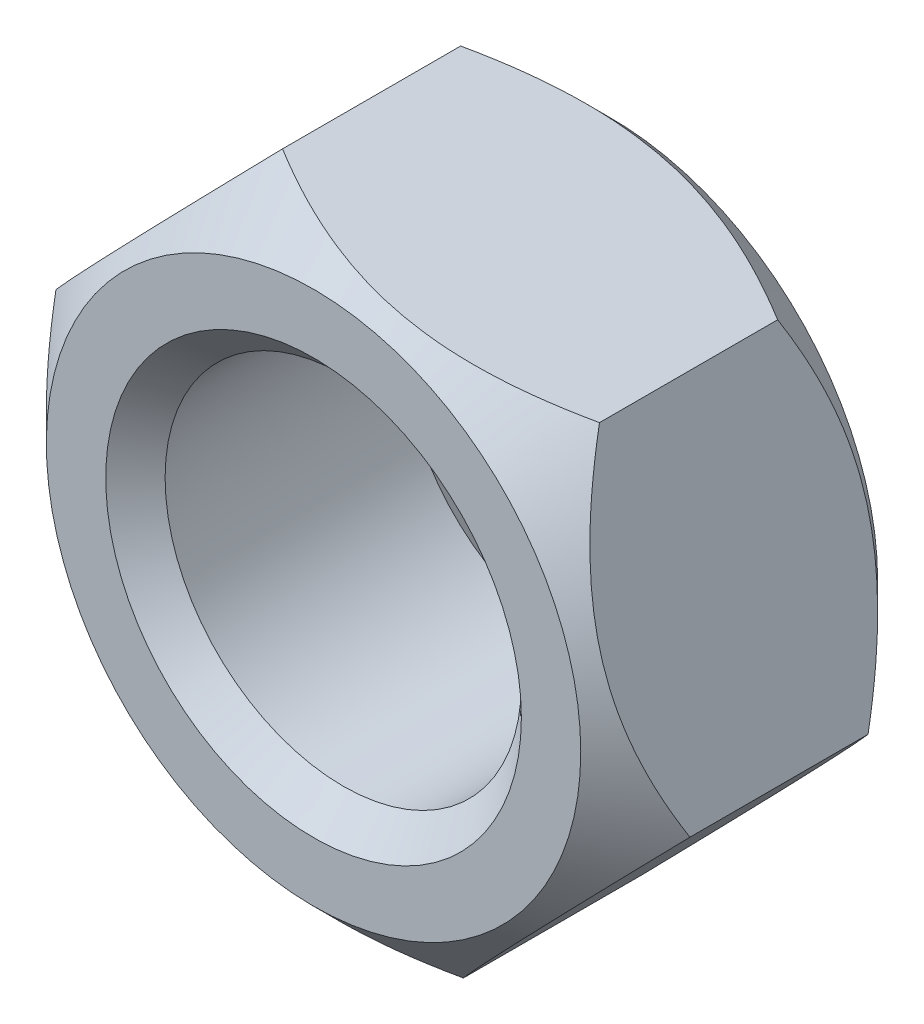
from build123d import *

# Parameters (mm, degrees)
ESQUISSE1_R                  = 5.5
ESQUISSE1_R_2                = 3
BOSS_EXTRU_1_DEPTH           = 5
CHANFREIN1_SIZE              = 1
CHANFREIN2_SIZE              = 0.5
ENL_V_MAT_EXTRU_1_DEPTH      = 10.246621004
R_P_TITION_CIRCULAIRE1_COUNT = 6


with BuildPart() as part:
    # Esquisse1 → Boss.-Extru.1 (new body)
    with BuildSketch(Plane.XY):
        Circle(ESQUISSE1_R)
        Circle(ESQUISSE1_R_2, mode=Mode.SUBTRACT)
    extrude(amount=BOSS_EXTRU_1_DEPTH)

    # Chanfrein1
    chanfrein1_edges = [part.edges().sort_by_distance(p)[0] for p in [
        (-5.5, 0, 0),
        (-5.5, 0, 5),
    ]]
    chamfer(chanfrein1_edges, length=CHANFREIN1_SIZE)

    # Chanfrein2
    chanfrein2_edges = [part.edges().sort_by_distance(p)[0] for p in [
        (-3, 0, 0),
        (-3, 0, 5),
    ]]
    chamfer(chanfrein2_edges, length=CHANFREIN2_SIZE)

    # Esquisse2 → Enl_v. mat.-Extru.1 (cut, through all)
    with BuildSketch(Plane.XY.offset(5)):
        with BuildLine():
            Line((-3.815449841, -3.961356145), (-5.338359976, 1.323598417))
            ThreePointArc((-5.338359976, 1.323598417), (-5.284954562, -1.522910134), (-3.815449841, -3.961356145))
        make_face()
    enl_v_mat_extru_1 = extrude(amount=-ENL_V_MAT_EXTRU_1_DEPTH, mode=Mode.SUBTRACT)

    # R_p_tition circulaire1: Enl_v. mat.-Extru.1 ×6 about axis
    r_p_tition_circulaire1_axis = Axis((0, 0, 0), (0, 0, 1))
    for i in range(1, R_P_TITION_CIRCULAIRE1_COUNT):
        add(enl_v_mat_extru_1.rotate(r_p_tition_circulaire1_axis, i * 360 / R_P_TITION_CIRCULAIRE1_COUNT), mode=Mode.SUBTRACT)


solid = part.part
